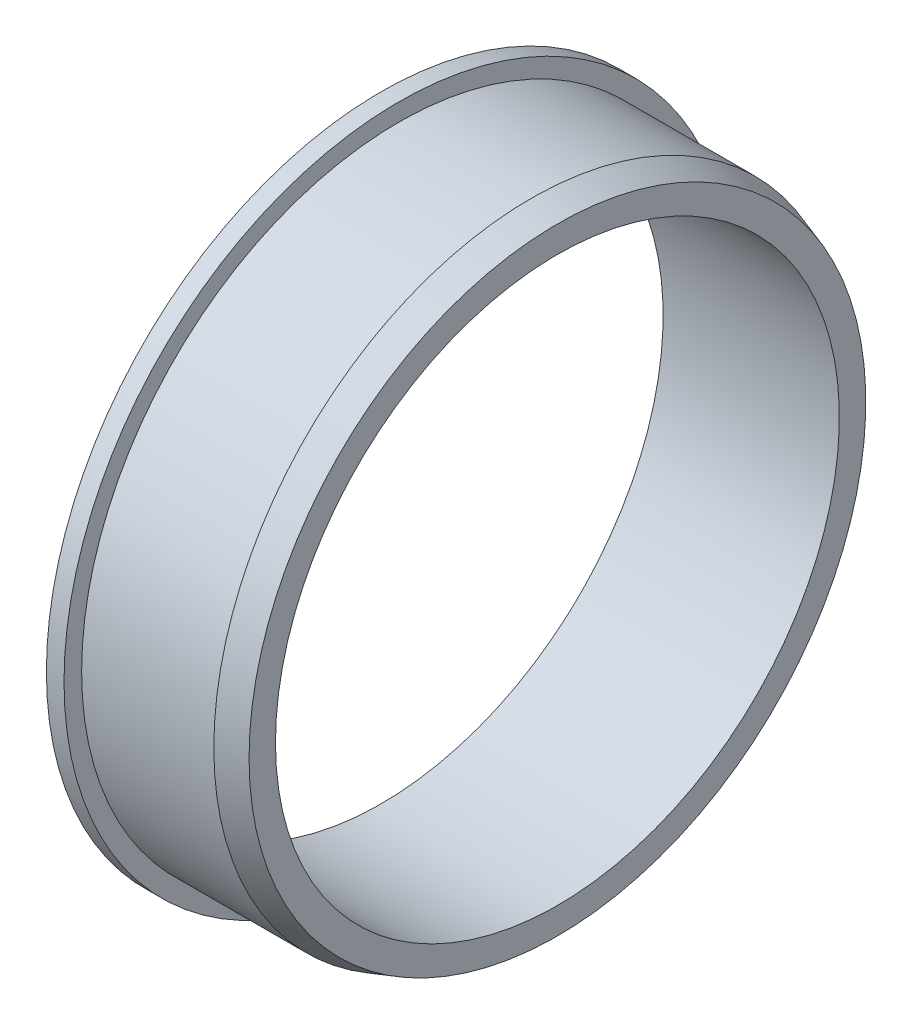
ISO-10303-21;
HEADER;
FILE_DESCRIPTION(('STEP AP214'),'2;1');
FILE_NAME('part.step','',(''),(''),'','','');
FILE_SCHEMA(('AUTOMOTIVE_DESIGN { 1 0 10303 214 1 1 1 1 }'));
ENDSEC;
DATA;
#1=APPLICATION_CONTEXT('core data for automotive mechanical design processes');
#2=APPLICATION_PROTOCOL_DEFINITION('international standard','automotive_design',2000,#1);
#3=PRODUCT_CONTEXT('',#1,'mechanical');
#4=PRODUCT('Part','Part','',(#3));
#5=PRODUCT_RELATED_PRODUCT_CATEGORY('part','',(#4));
#6=PRODUCT_DEFINITION_FORMATION('','',#4);
#7=PRODUCT_DEFINITION_CONTEXT('part definition',#1,'design');
#8=PRODUCT_DEFINITION('design','',#6,#7);
#9=PRODUCT_DEFINITION_SHAPE('','',#8);
#10=(LENGTH_UNIT() NAMED_UNIT(*) SI_UNIT(.MILLI.,.METRE.));
#11=(NAMED_UNIT(*) PLANE_ANGLE_UNIT() SI_UNIT($,.RADIAN.));
#12=(NAMED_UNIT(*) SI_UNIT($,.STERADIAN.) SOLID_ANGLE_UNIT());
#13=UNCERTAINTY_MEASURE_WITH_UNIT(LENGTH_MEASURE(1.E-05),#10,'distance_accuracy_value','');
#14=(GEOMETRIC_REPRESENTATION_CONTEXT(3) GLOBAL_UNCERTAINTY_ASSIGNED_CONTEXT((#13)) GLOBAL_UNIT_ASSIGNED_CONTEXT((#10,
#11,#12)) REPRESENTATION_CONTEXT('',''));
#15=CARTESIAN_POINT('',(0.,0.,0.));
#16=DIRECTION('',(0.,0.,1.));
#17=DIRECTION('',(1.,0.,0.));
#18=AXIS2_PLACEMENT_3D('',#15,#16,#17);
#19=CARTESIAN_POINT('',(-0.95,0.,0.));
#20=DIRECTION('',(-1.,0.,0.));
#21=DIRECTION('',(0.,0.,1.));
#22=AXIS2_PLACEMENT_3D('',#19,#20,#21);
#23=CYLINDRICAL_SURFACE('',#22,8.);
#24=CARTESIAN_POINT('',(0.,0.,0.));
#25=DIRECTION('',(-1.,0.,0.));
#26=DIRECTION('',(0.,0.,1.));
#27=AXIS2_PLACEMENT_3D('',#24,#25,#26);
#28=CIRCLE('',#27,8.);
#29=CARTESIAN_POINT('',(0.,0.,8.));
#30=VERTEX_POINT('',#29);
#31=EDGE_CURVE('E10',#30,#30,#28,.T.);
#32=ORIENTED_EDGE('',*,*,#31,.T.);
#33=EDGE_LOOP('',(#32));
#34=FACE_BOUND('',#33,.T.);
#35=CARTESIAN_POINT('',(5.,0.,0.));
#36=DIRECTION('',(-1.,0.,0.));
#37=DIRECTION('',(0.,0.,1.));
#38=AXIS2_PLACEMENT_3D('',#35,#36,#37);
#39=CIRCLE('',#38,8.);
#40=CARTESIAN_POINT('',(5.,0.,8.));
#41=VERTEX_POINT('',#40);
#42=EDGE_CURVE('E58',#41,#41,#39,.T.);
#43=ORIENTED_EDGE('',*,*,#42,.F.);
#44=EDGE_LOOP('',(#43));
#45=FACE_BOUND('',#44,.T.);
#46=ADVANCED_FACE('F33',(#34,#45),#23,.F.);
#47=CARTESIAN_POINT('',(0.,8.,0.));
#48=DIRECTION('',(-1.,0.,0.));
#49=DIRECTION('',(0.,0.,1.));
#50=AXIS2_PLACEMENT_3D('',#47,#48,#49);
#51=PLANE('',#50);
#52=CARTESIAN_POINT('',(0.,0.,0.));
#53=DIRECTION('',(-1.,0.,0.));
#54=DIRECTION('',(0.,0.,1.));
#55=AXIS2_PLACEMENT_3D('',#52,#53,#54);
#56=CIRCLE('',#55,9.5);
#57=CARTESIAN_POINT('',(0.,0.,9.5));
#58=VERTEX_POINT('',#57);
#59=EDGE_CURVE('E39',#58,#58,#56,.T.);
#60=ORIENTED_EDGE('',*,*,#59,.T.);
#61=EDGE_LOOP('',(#60));
#62=FACE_BOUND('',#61,.T.);
#63=ORIENTED_EDGE('',*,*,#31,.F.);
#64=EDGE_LOOP('',(#63));
#65=FACE_BOUND('',#64,.T.);
#66=ADVANCED_FACE('F66',(#62,#65),#51,.T.);
#67=CARTESIAN_POINT('',(-0.95,0.,0.));
#68=DIRECTION('',(-1.,0.,0.));
#69=DIRECTION('',(0.,0.,1.));
#70=AXIS2_PLACEMENT_3D('',#67,#68,#69);
#71=CYLINDRICAL_SURFACE('',#70,9.5);
#72=CARTESIAN_POINT('',(0.500000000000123,0.,0.));
#73=DIRECTION('',(-1.,0.,0.));
#74=DIRECTION('',(0.,0.,1.));
#75=AXIS2_PLACEMENT_3D('',#72,#73,#74);
#76=CIRCLE('',#75,9.5);
#77=CARTESIAN_POINT('',(0.500000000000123,0.,9.5));
#78=VERTEX_POINT('',#77);
#79=EDGE_CURVE('E43',#78,#78,#76,.T.);
#80=ORIENTED_EDGE('',*,*,#79,.T.);
#81=EDGE_LOOP('',(#80));
#82=FACE_BOUND('',#81,.T.);
#83=ORIENTED_EDGE('',*,*,#59,.F.);
#84=EDGE_LOOP('',(#83));
#85=FACE_BOUND('',#84,.T.);
#86=ADVANCED_FACE('F70',(#82,#85),#71,.T.);
#87=CARTESIAN_POINT('',(0.500000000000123,9.5,0.));
#88=DIRECTION('',(1.,0.,0.));
#89=DIRECTION('',(0.,0.,-1.));
#90=AXIS2_PLACEMENT_3D('',#87,#88,#89);
#91=PLANE('',#90);
#92=CARTESIAN_POINT('',(0.500000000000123,0.,0.));
#93=DIRECTION('',(-1.,0.,0.));
#94=DIRECTION('',(0.,0.,1.));
#95=AXIS2_PLACEMENT_3D('',#92,#93,#94);
#96=CIRCLE('',#95,9.);
#97=CARTESIAN_POINT('',(0.500000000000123,0.,9.));
#98=VERTEX_POINT('',#97);
#99=EDGE_CURVE('E47',#98,#98,#96,.T.);
#100=ORIENTED_EDGE('',*,*,#99,.T.);
#101=EDGE_LOOP('',(#100));
#102=FACE_BOUND('',#101,.T.);
#103=ORIENTED_EDGE('',*,*,#79,.F.);
#104=EDGE_LOOP('',(#103));
#105=FACE_BOUND('',#104,.T.);
#106=ADVANCED_FACE('F74',(#102,#105),#91,.T.);
#107=CARTESIAN_POINT('',(-0.95,0.,0.));
#108=DIRECTION('',(-1.,0.,0.));
#109=DIRECTION('',(0.,0.,1.));
#110=AXIS2_PLACEMENT_3D('',#107,#108,#109);
#111=CYLINDRICAL_SURFACE('',#110,9.);
#112=CARTESIAN_POINT('',(4.25,0.,0.));
#113=DIRECTION('',(-1.,0.,0.));
#114=DIRECTION('',(0.,0.,1.));
#115=AXIS2_PLACEMENT_3D('',#112,#113,#114);
#116=CIRCLE('',#115,9.);
#117=CARTESIAN_POINT('',(4.25,0.,9.));
#118=VERTEX_POINT('',#117);
#119=EDGE_CURVE('E52',#118,#118,#116,.T.);
#120=ORIENTED_EDGE('',*,*,#119,.T.);
#121=EDGE_LOOP('',(#120));
#122=FACE_BOUND('',#121,.T.);
#123=ORIENTED_EDGE('',*,*,#99,.F.);
#124=EDGE_LOOP('',(#123));
#125=FACE_BOUND('',#124,.T.);
#126=ADVANCED_FACE('F81',(#122,#125),#111,.T.);
#127=CARTESIAN_POINT('',(4.25,0.,0.));
#128=DIRECTION('',(-1.,0.,0.));
#129=DIRECTION('',(0.,0.,1.));
#130=AXIS2_PLACEMENT_3D('',#127,#128,#129);
#131=CONICAL_SURFACE('',#130,9.,0.321750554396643);
#132=CARTESIAN_POINT('',(5.,0.,0.));
#133=DIRECTION('',(-1.,0.,0.));
#134=DIRECTION('',(0.,0.,1.));
#135=AXIS2_PLACEMENT_3D('',#132,#133,#134);
#136=CIRCLE('',#135,8.75);
#137=CARTESIAN_POINT('',(5.,0.,8.75));
#138=VERTEX_POINT('',#137);
#139=EDGE_CURVE('E55',#138,#138,#136,.T.);
#140=ORIENTED_EDGE('',*,*,#139,.T.);
#141=EDGE_LOOP('',(#140));
#142=FACE_BOUND('',#141,.T.);
#143=ORIENTED_EDGE('',*,*,#119,.F.);
#144=EDGE_LOOP('',(#143));
#145=FACE_BOUND('',#144,.T.);
#146=ADVANCED_FACE('F85',(#142,#145),#131,.T.);
#147=CARTESIAN_POINT('',(5.,8.75,0.));
#148=DIRECTION('',(1.,0.,0.));
#149=DIRECTION('',(0.,0.,-1.));
#150=AXIS2_PLACEMENT_3D('',#147,#148,#149);
#151=PLANE('',#150);
#152=ORIENTED_EDGE('',*,*,#42,.T.);
#153=EDGE_LOOP('',(#152));
#154=FACE_BOUND('',#153,.T.);
#155=ORIENTED_EDGE('',*,*,#139,.F.);
#156=EDGE_LOOP('',(#155));
#157=FACE_BOUND('',#156,.T.);
#158=ADVANCED_FACE('F62',(#154,#157),#151,.T.);
#159=CLOSED_SHELL('',(#46,#66,#86,#106,#126,#146,#158));
#160=MANIFOLD_SOLID_BREP('B2',#159);
#161=ADVANCED_BREP_SHAPE_REPRESENTATION('',(#18,#160),#14);
#162=SHAPE_DEFINITION_REPRESENTATION(#9,#161);
ENDSEC;
END-ISO-10303-21;
